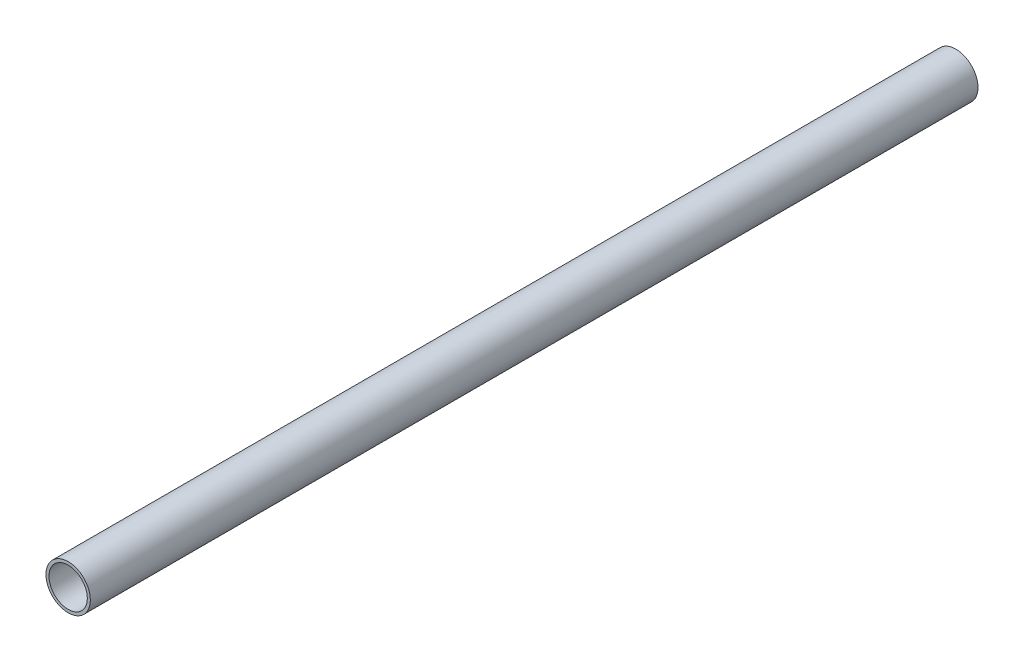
from build123d import *

# Parameters (mm, degrees)
CROQUIS1_R              = 11
CROQUIS1_R_2            = 9.5
SALIENTE_EXTRUIR1_DEPTH = 440


with BuildPart() as part:
    # Croquis1 → Saliente-Extruir1 (new body)
    with BuildSketch(Plane.XY):
        Circle(CROQUIS1_R)
        Circle(CROQUIS1_R_2, mode=Mode.SUBTRACT)
    extrude(amount=SALIENTE_EXTRUIR1_DEPTH)


solid = part.part
